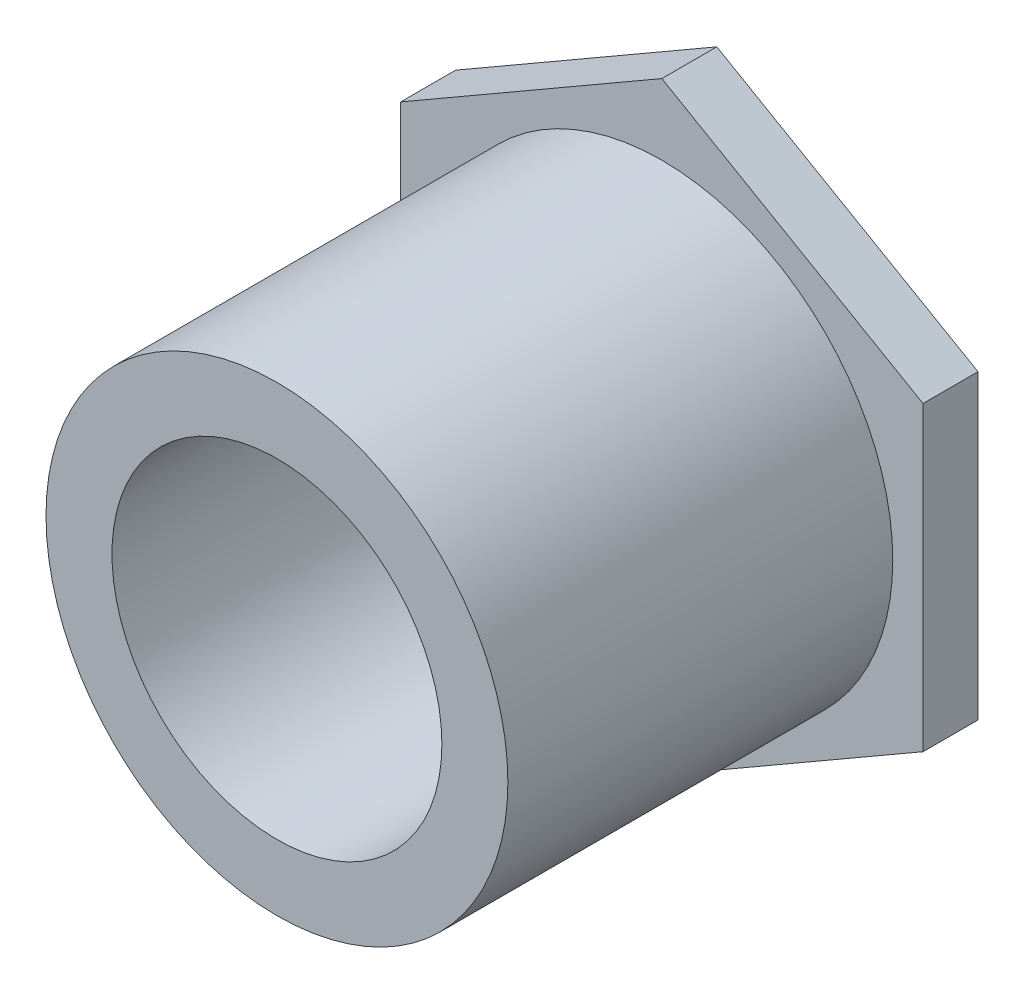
ISO-10303-21;
HEADER;
FILE_DESCRIPTION(('STEP AP214'),'2;1');
FILE_NAME('part.step','',(''),(''),'','','');
FILE_SCHEMA(('AUTOMOTIVE_DESIGN { 1 0 10303 214 1 1 1 1 }'));
ENDSEC;
DATA;
#1=APPLICATION_CONTEXT('core data for automotive mechanical design processes');
#2=APPLICATION_PROTOCOL_DEFINITION('international standard','automotive_design',2000,#1);
#3=PRODUCT_CONTEXT('',#1,'mechanical');
#4=PRODUCT('Part','Part','',(#3));
#5=PRODUCT_RELATED_PRODUCT_CATEGORY('part','',(#4));
#6=PRODUCT_DEFINITION_FORMATION('','',#4);
#7=PRODUCT_DEFINITION_CONTEXT('part definition',#1,'design');
#8=PRODUCT_DEFINITION('design','',#6,#7);
#9=PRODUCT_DEFINITION_SHAPE('','',#8);
#10=(LENGTH_UNIT() NAMED_UNIT(*) SI_UNIT(.MILLI.,.METRE.));
#11=(NAMED_UNIT(*) PLANE_ANGLE_UNIT() SI_UNIT($,.RADIAN.));
#12=(NAMED_UNIT(*) SI_UNIT($,.STERADIAN.) SOLID_ANGLE_UNIT());
#13=UNCERTAINTY_MEASURE_WITH_UNIT(LENGTH_MEASURE(1.E-05),#10,'distance_accuracy_value','');
#14=(GEOMETRIC_REPRESENTATION_CONTEXT(3) GLOBAL_UNCERTAINTY_ASSIGNED_CONTEXT((#13)) GLOBAL_UNIT_ASSIGNED_CONTEXT((#10,
#11,#12)) REPRESENTATION_CONTEXT('',''));
#15=CARTESIAN_POINT('',(0.,0.,0.));
#16=DIRECTION('',(0.,0.,1.));
#17=DIRECTION('',(1.,0.,0.));
#18=AXIS2_PLACEMENT_3D('',#15,#16,#17);
#19=CARTESIAN_POINT('',(0.,0.,4.));
#20=DIRECTION('',(0.,0.,-1.));
#21=DIRECTION('',(-1.,0.,0.));
#22=AXIS2_PLACEMENT_3D('',#19,#20,#21);
#23=CYLINDRICAL_SURFACE('',#22,1.5);
#24=CARTESIAN_POINT('',(0.,0.,4.));
#25=DIRECTION('',(0.,0.,1.));
#26=DIRECTION('',(1.,0.,0.));
#27=AXIS2_PLACEMENT_3D('',#24,#25,#26);
#28=CIRCLE('',#27,1.5);
#29=CARTESIAN_POINT('',(1.5,0.,4.));
#30=VERTEX_POINT('',#29);
#31=EDGE_CURVE('E50',#30,#30,#28,.T.);
#32=ORIENTED_EDGE('',*,*,#31,.T.);
#33=EDGE_LOOP('',(#32));
#34=FACE_BOUND('',#33,.T.);
#35=CARTESIAN_POINT('',(0.,0.,0.));
#36=DIRECTION('',(0.,0.,1.));
#37=DIRECTION('',(1.,0.,0.));
#38=AXIS2_PLACEMENT_3D('',#35,#36,#37);
#39=CIRCLE('',#38,1.5);
#40=CARTESIAN_POINT('',(1.5,0.,0.));
#41=VERTEX_POINT('',#40);
#42=EDGE_CURVE('E44',#41,#41,#39,.T.);
#43=ORIENTED_EDGE('',*,*,#42,.F.);
#44=EDGE_LOOP('',(#43));
#45=FACE_BOUND('',#44,.T.);
#46=ADVANCED_FACE('F41',(#34,#45),#23,.F.);
#47=CARTESIAN_POINT('',(0.,0.,4.));
#48=DIRECTION('',(0.,0.,-1.));
#49=DIRECTION('',(-1.,0.,0.));
#50=AXIS2_PLACEMENT_3D('',#47,#48,#49);
#51=CYLINDRICAL_SURFACE('',#50,2.1);
#52=CARTESIAN_POINT('',(0.,0.,0.5));
#53=DIRECTION('',(0.,0.,1.));
#54=DIRECTION('',(1.,0.,0.));
#55=AXIS2_PLACEMENT_3D('',#52,#53,#54);
#56=CIRCLE('',#55,2.1);
#57=CARTESIAN_POINT('',(2.1,0.,0.5));
#58=VERTEX_POINT('',#57);
#59=EDGE_CURVE('E137',#58,#58,#56,.T.);
#60=ORIENTED_EDGE('',*,*,#59,.T.);
#61=EDGE_LOOP('',(#60));
#62=FACE_BOUND('',#61,.T.);
#63=CARTESIAN_POINT('',(0.,0.,4.));
#64=DIRECTION('',(0.,0.,1.));
#65=DIRECTION('',(1.,0.,0.));
#66=AXIS2_PLACEMENT_3D('',#63,#64,#65);
#67=CIRCLE('',#66,2.1);
#68=CARTESIAN_POINT('',(2.1,0.,4.));
#69=VERTEX_POINT('',#68);
#70=EDGE_CURVE('E11',#69,#69,#67,.T.);
#71=ORIENTED_EDGE('',*,*,#70,.F.);
#72=EDGE_LOOP('',(#71));
#73=FACE_BOUND('',#72,.T.);
#74=ADVANCED_FACE('F156',(#62,#73),#51,.T.);
#75=CARTESIAN_POINT('',(0.,0.,4.));
#76=DIRECTION('',(0.,0.,1.));
#77=DIRECTION('',(1.,0.,0.));
#78=AXIS2_PLACEMENT_3D('',#75,#76,#77);
#79=PLANE('',#78);
#80=ORIENTED_EDGE('',*,*,#31,.F.);
#81=EDGE_LOOP('',(#80));
#82=FACE_BOUND('',#81,.T.);
#83=ORIENTED_EDGE('',*,*,#70,.T.);
#84=EDGE_LOOP('',(#83));
#85=FACE_BOUND('',#84,.T.);
#86=ADVANCED_FACE('F161',(#82,#85),#79,.T.);
#87=CARTESIAN_POINT('',(0.,0.,0.));
#88=DIRECTION('',(0.,0.,1.));
#89=DIRECTION('',(1.,0.,0.));
#90=AXIS2_PLACEMENT_3D('',#87,#88,#89);
#91=PLANE('',#90);
#92=ORIENTED_EDGE('',*,*,#42,.T.);
#93=EDGE_LOOP('',(#92));
#94=FACE_BOUND('',#93,.T.);
#95=DIRECTION('',(0.,1.,0.));
#96=VECTOR('',#95,1.);
#97=CARTESIAN_POINT('',(2.375,0.,0.));
#98=LINE('',#97,#96);
#99=CARTESIAN_POINT('',(2.375,-1.37120688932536,0.));
#100=VERTEX_POINT('',#99);
#101=CARTESIAN_POINT('',(2.375,1.37120688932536,0.));
#102=VERTEX_POINT('',#101);
#103=EDGE_CURVE('E127',#100,#102,#98,.T.);
#104=ORIENTED_EDGE('',*,*,#103,.F.);
#105=DIRECTION('',(0.866025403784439,0.5,0.));
#106=VECTOR('',#105,1.);
#107=CARTESIAN_POINT('',(1.1875,-2.05681033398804,0.));
#108=LINE('',#107,#106);
#109=CARTESIAN_POINT('',(0.,-2.74241377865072,0.));
#110=VERTEX_POINT('',#109);
#111=EDGE_CURVE('E87',#110,#100,#108,.T.);
#112=ORIENTED_EDGE('',*,*,#111,.F.);
#113=DIRECTION('',(0.866025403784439,-0.5,0.));
#114=VECTOR('',#113,1.);
#115=CARTESIAN_POINT('',(-1.1875,-2.05681033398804,0.));
#116=LINE('',#115,#114);
#117=CARTESIAN_POINT('',(-2.375,-1.37120688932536,0.));
#118=VERTEX_POINT('',#117);
#119=EDGE_CURVE('E81',#118,#110,#116,.T.);
#120=ORIENTED_EDGE('',*,*,#119,.F.);
#121=DIRECTION('',(0.,-1.,0.));
#122=VECTOR('',#121,1.);
#123=CARTESIAN_POINT('',(-2.375,0.,0.));
#124=LINE('',#123,#122);
#125=CARTESIAN_POINT('',(-2.375,1.37120688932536,0.));
#126=VERTEX_POINT('',#125);
#127=EDGE_CURVE('E117',#126,#118,#124,.T.);
#128=ORIENTED_EDGE('',*,*,#127,.F.);
#129=DIRECTION('',(-0.866025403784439,-0.5,0.));
#130=VECTOR('',#129,1.);
#131=CARTESIAN_POINT('',(-1.1875,2.05681033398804,0.));
#132=LINE('',#131,#130);
#133=CARTESIAN_POINT('',(0.,2.74241377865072,0.));
#134=VERTEX_POINT('',#133);
#135=EDGE_CURVE('E132',#134,#126,#132,.T.);
#136=ORIENTED_EDGE('',*,*,#135,.F.);
#137=DIRECTION('',(-0.866025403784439,0.5,0.));
#138=VECTOR('',#137,1.);
#139=CARTESIAN_POINT('',(1.1875,2.05681033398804,0.));
#140=LINE('',#139,#138);
#141=EDGE_CURVE('E130',#102,#134,#140,.T.);
#142=ORIENTED_EDGE('',*,*,#141,.F.);
#143=EDGE_LOOP('',(#104,#112,#120,#128,#136,#142));
#144=FACE_BOUND('',#143,.T.);
#145=ADVANCED_FACE('F152',(#94,#144),#91,.F.);
#146=CARTESIAN_POINT('',(2.375,0.,0.5));
#147=DIRECTION('',(-1.,0.,0.));
#148=DIRECTION('',(0.,0.,1.));
#149=AXIS2_PLACEMENT_3D('',#146,#147,#148);
#150=PLANE('',#149);
#151=ORIENTED_EDGE('',*,*,#103,.T.);
#152=DIRECTION('',(0.,0.,-1.));
#153=VECTOR('',#152,1.);
#154=CARTESIAN_POINT('',(2.375,1.37120688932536,0.5));
#155=LINE('',#154,#153);
#156=CARTESIAN_POINT('',(2.375,1.37120688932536,0.5));
#157=VERTEX_POINT('',#156);
#158=EDGE_CURVE('E144',#157,#102,#155,.T.);
#159=ORIENTED_EDGE('',*,*,#158,.F.);
#160=DIRECTION('',(0.,1.,0.));
#161=VECTOR('',#160,1.);
#162=CARTESIAN_POINT('',(2.375,0.,0.5));
#163=LINE('',#162,#161);
#164=CARTESIAN_POINT('',(2.375,-1.37120688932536,0.5));
#165=VERTEX_POINT('',#164);
#166=EDGE_CURVE('E195',#165,#157,#163,.T.);
#167=ORIENTED_EDGE('',*,*,#166,.F.);
#168=DIRECTION('',(0.,0.,-1.));
#169=VECTOR('',#168,1.);
#170=CARTESIAN_POINT('',(2.375,-1.37120688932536,0.5));
#171=LINE('',#170,#169);
#172=EDGE_CURVE('E123',#165,#100,#171,.T.);
#173=ORIENTED_EDGE('',*,*,#172,.T.);
#174=EDGE_LOOP('',(#151,#159,#167,#173));
#175=FACE_BOUND('',#174,.T.);
#176=ADVANCED_FACE('F171',(#175),#150,.F.);
#177=CARTESIAN_POINT('',(1.1875,2.05681033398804,0.5));
#178=DIRECTION('',(-0.5,-0.866025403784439,0.));
#179=DIRECTION('',(0.866025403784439,-0.5,0.));
#180=AXIS2_PLACEMENT_3D('',#177,#178,#179);
#181=PLANE('',#180);
#182=ORIENTED_EDGE('',*,*,#141,.T.);
#183=DIRECTION('',(0.,0.,-1.));
#184=VECTOR('',#183,1.);
#185=CARTESIAN_POINT('',(0.,2.74241377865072,0.5));
#186=LINE('',#185,#184);
#187=CARTESIAN_POINT('',(0.,2.74241377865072,0.5));
#188=VERTEX_POINT('',#187);
#189=EDGE_CURVE('E141',#188,#134,#186,.T.);
#190=ORIENTED_EDGE('',*,*,#189,.F.);
#191=DIRECTION('',(-0.866025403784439,0.5,0.));
#192=VECTOR('',#191,1.);
#193=CARTESIAN_POINT('',(1.1875,2.05681033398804,0.5));
#194=LINE('',#193,#192);
#195=EDGE_CURVE('E96',#157,#188,#194,.T.);
#196=ORIENTED_EDGE('',*,*,#195,.F.);
#197=ORIENTED_EDGE('',*,*,#158,.T.);
#198=EDGE_LOOP('',(#182,#190,#196,#197));
#199=FACE_BOUND('',#198,.T.);
#200=ADVANCED_FACE('F175',(#199),#181,.F.);
#201=CARTESIAN_POINT('',(-1.1875,2.05681033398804,0.5));
#202=DIRECTION('',(0.5,-0.866025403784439,0.));
#203=DIRECTION('',(0.866025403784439,0.5,0.));
#204=AXIS2_PLACEMENT_3D('',#201,#202,#203);
#205=PLANE('',#204);
#206=ORIENTED_EDGE('',*,*,#135,.T.);
#207=DIRECTION('',(0.,0.,-1.));
#208=VECTOR('',#207,1.);
#209=CARTESIAN_POINT('',(-2.375,1.37120688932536,0.5));
#210=LINE('',#209,#208);
#211=CARTESIAN_POINT('',(-2.375,1.37120688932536,0.5));
#212=VERTEX_POINT('',#211);
#213=EDGE_CURVE('E118',#212,#126,#210,.T.);
#214=ORIENTED_EDGE('',*,*,#213,.F.);
#215=DIRECTION('',(-0.866025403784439,-0.5,0.));
#216=VECTOR('',#215,1.);
#217=CARTESIAN_POINT('',(-1.1875,2.05681033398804,0.5));
#218=LINE('',#217,#216);
#219=EDGE_CURVE('E109',#188,#212,#218,.T.);
#220=ORIENTED_EDGE('',*,*,#219,.F.);
#221=ORIENTED_EDGE('',*,*,#189,.T.);
#222=EDGE_LOOP('',(#206,#214,#220,#221));
#223=FACE_BOUND('',#222,.T.);
#224=ADVANCED_FACE('F179',(#223),#205,.F.);
#225=CARTESIAN_POINT('',(-2.375,0.,0.5));
#226=DIRECTION('',(1.,0.,0.));
#227=DIRECTION('',(0.,0.,-1.));
#228=AXIS2_PLACEMENT_3D('',#225,#226,#227);
#229=PLANE('',#228);
#230=ORIENTED_EDGE('',*,*,#127,.T.);
#231=DIRECTION('',(0.,0.,-1.));
#232=VECTOR('',#231,1.);
#233=CARTESIAN_POINT('',(-2.375,-1.37120688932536,0.5));
#234=LINE('',#233,#232);
#235=CARTESIAN_POINT('',(-2.375,-1.37120688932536,0.5));
#236=VERTEX_POINT('',#235);
#237=EDGE_CURVE('E114',#236,#118,#234,.T.);
#238=ORIENTED_EDGE('',*,*,#237,.F.);
#239=DIRECTION('',(0.,-1.,0.));
#240=VECTOR('',#239,1.);
#241=CARTESIAN_POINT('',(-2.375,0.,0.5));
#242=LINE('',#241,#240);
#243=EDGE_CURVE('E103',#212,#236,#242,.T.);
#244=ORIENTED_EDGE('',*,*,#243,.F.);
#245=ORIENTED_EDGE('',*,*,#213,.T.);
#246=EDGE_LOOP('',(#230,#238,#244,#245));
#247=FACE_BOUND('',#246,.T.);
#248=ADVANCED_FACE('F115',(#247),#229,.F.);
#249=CARTESIAN_POINT('',(-1.1875,-2.05681033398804,0.5));
#250=DIRECTION('',(0.5,0.866025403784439,0.));
#251=DIRECTION('',(-0.866025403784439,0.5,0.));
#252=AXIS2_PLACEMENT_3D('',#249,#250,#251);
#253=PLANE('',#252);
#254=ORIENTED_EDGE('',*,*,#119,.T.);
#255=DIRECTION('',(0.,0.,-1.));
#256=VECTOR('',#255,1.);
#257=CARTESIAN_POINT('',(0.,-2.74241377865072,0.5));
#258=LINE('',#257,#256);
#259=CARTESIAN_POINT('',(0.,-2.74241377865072,0.5));
#260=VERTEX_POINT('',#259);
#261=EDGE_CURVE('E119',#260,#110,#258,.T.);
#262=ORIENTED_EDGE('',*,*,#261,.F.);
#263=DIRECTION('',(0.866025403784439,-0.5,0.));
#264=VECTOR('',#263,1.);
#265=CARTESIAN_POINT('',(-1.1875,-2.05681033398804,0.5));
#266=LINE('',#265,#264);
#267=EDGE_CURVE('E107',#236,#260,#266,.T.);
#268=ORIENTED_EDGE('',*,*,#267,.F.);
#269=ORIENTED_EDGE('',*,*,#237,.T.);
#270=EDGE_LOOP('',(#254,#262,#268,#269));
#271=FACE_BOUND('',#270,.T.);
#272=ADVANCED_FACE('F121',(#271),#253,.F.);
#273=CARTESIAN_POINT('',(1.1875,-2.05681033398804,0.5));
#274=DIRECTION('',(-0.5,0.866025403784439,0.));
#275=DIRECTION('',(-0.866025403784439,-0.5,0.));
#276=AXIS2_PLACEMENT_3D('',#273,#274,#275);
#277=PLANE('',#276);
#278=ORIENTED_EDGE('',*,*,#111,.T.);
#279=ORIENTED_EDGE('',*,*,#172,.F.);
#280=DIRECTION('',(0.866025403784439,0.5,0.));
#281=VECTOR('',#280,1.);
#282=CARTESIAN_POINT('',(1.1875,-2.05681033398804,0.5));
#283=LINE('',#282,#281);
#284=EDGE_CURVE('E58',#260,#165,#283,.T.);
#285=ORIENTED_EDGE('',*,*,#284,.F.);
#286=ORIENTED_EDGE('',*,*,#261,.T.);
#287=EDGE_LOOP('',(#278,#279,#285,#286));
#288=FACE_BOUND('',#287,.T.);
#289=ADVANCED_FACE('F187',(#288),#277,.F.);
#290=CARTESIAN_POINT('',(0.,0.,0.5));
#291=DIRECTION('',(0.,0.,1.));
#292=DIRECTION('',(1.,0.,0.));
#293=AXIS2_PLACEMENT_3D('',#290,#291,#292);
#294=PLANE('',#293);
#295=ORIENTED_EDGE('',*,*,#59,.F.);
#296=EDGE_LOOP('',(#295));
#297=FACE_BOUND('',#296,.T.);
#298=ORIENTED_EDGE('',*,*,#166,.T.);
#299=ORIENTED_EDGE('',*,*,#195,.T.);
#300=ORIENTED_EDGE('',*,*,#219,.T.);
#301=ORIENTED_EDGE('',*,*,#243,.T.);
#302=ORIENTED_EDGE('',*,*,#267,.T.);
#303=ORIENTED_EDGE('',*,*,#284,.T.);
#304=EDGE_LOOP('',(#298,#299,#300,#301,#302,#303));
#305=FACE_BOUND('',#304,.T.);
#306=ADVANCED_FACE('F105',(#297,#305),#294,.T.);
#307=CLOSED_SHELL('',(#46,#74,#86,#145,#176,#200,#224,#248,#272,#289,#306));
#308=MANIFOLD_SOLID_BREP('B2',#307);
#309=ADVANCED_BREP_SHAPE_REPRESENTATION('',(#18,#308),#14);
#310=SHAPE_DEFINITION_REPRESENTATION(#9,#309);
ENDSEC;
END-ISO-10303-21;
